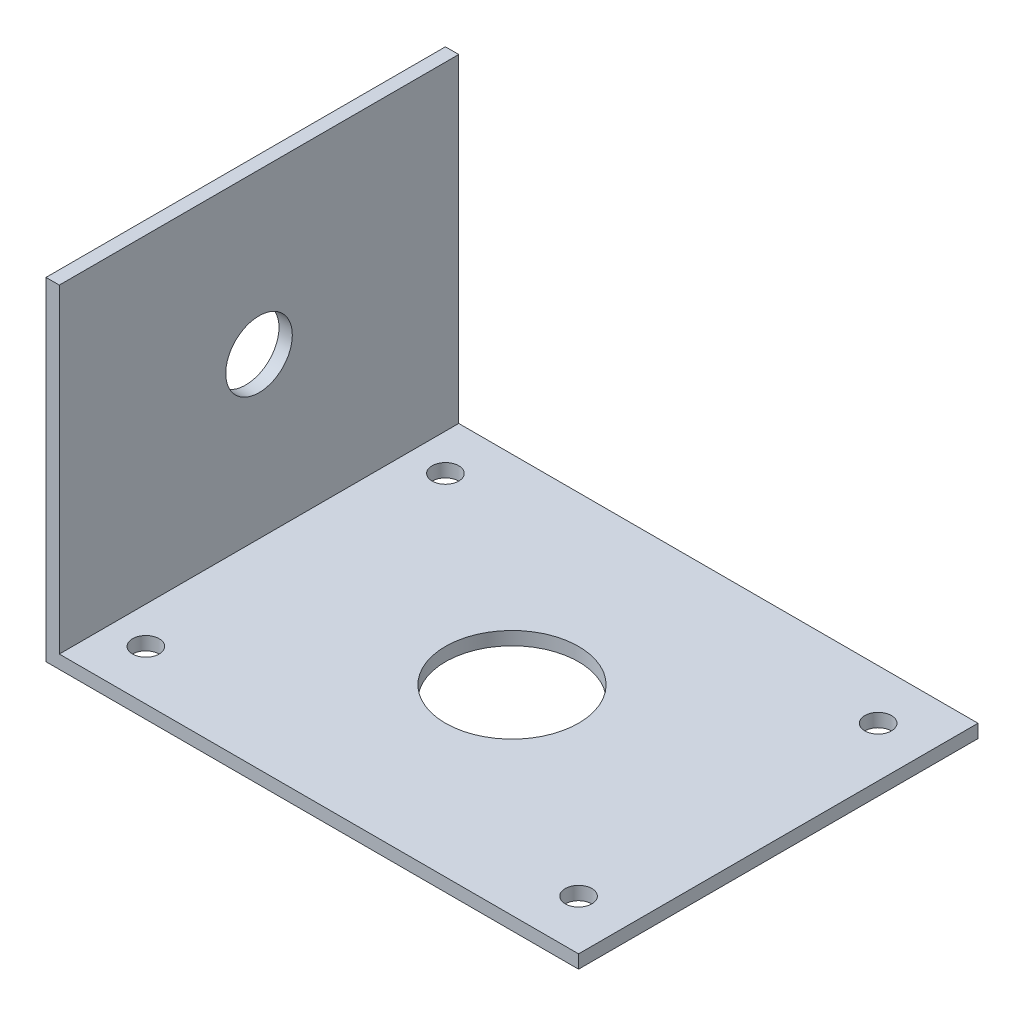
ISO-10303-21;
HEADER;
FILE_DESCRIPTION(('STEP AP214'),'2;1');
FILE_NAME('part.step','',(''),(''),'','','');
FILE_SCHEMA(('AUTOMOTIVE_DESIGN { 1 0 10303 214 1 1 1 1 }'));
ENDSEC;
DATA;
#1=APPLICATION_CONTEXT('core data for automotive mechanical design processes');
#2=APPLICATION_PROTOCOL_DEFINITION('international standard','automotive_design',2000,#1);
#3=PRODUCT_CONTEXT('',#1,'mechanical');
#4=PRODUCT('Part','Part','',(#3));
#5=PRODUCT_RELATED_PRODUCT_CATEGORY('part','',(#4));
#6=PRODUCT_DEFINITION_FORMATION('','',#4);
#7=PRODUCT_DEFINITION_CONTEXT('part definition',#1,'design');
#8=PRODUCT_DEFINITION('design','',#6,#7);
#9=PRODUCT_DEFINITION_SHAPE('','',#8);
#10=(LENGTH_UNIT() NAMED_UNIT(*) SI_UNIT(.MILLI.,.METRE.));
#11=(NAMED_UNIT(*) PLANE_ANGLE_UNIT() SI_UNIT($,.RADIAN.));
#12=(NAMED_UNIT(*) SI_UNIT($,.STERADIAN.) SOLID_ANGLE_UNIT());
#13=UNCERTAINTY_MEASURE_WITH_UNIT(LENGTH_MEASURE(1.E-05),#10,'distance_accuracy_value','');
#14=(GEOMETRIC_REPRESENTATION_CONTEXT(3) GLOBAL_UNCERTAINTY_ASSIGNED_CONTEXT((#13)) GLOBAL_UNIT_ASSIGNED_CONTEXT((#10,
#11,#12)) REPRESENTATION_CONTEXT('',''));
#15=CARTESIAN_POINT('',(0.,0.,0.));
#16=DIRECTION('',(0.,0.,1.));
#17=DIRECTION('',(1.,0.,0.));
#18=AXIS2_PLACEMENT_3D('',#15,#16,#17);
#19=CARTESIAN_POINT('',(0.,0.,76.2));
#20=DIRECTION('',(0.,1.,0.));
#21=DIRECTION('',(0.,0.,1.));
#22=AXIS2_PLACEMENT_3D('',#19,#20,#21);
#23=PLANE('',#22);
#24=CARTESIAN_POINT('',(92.075,0.,66.675));
#25=DIRECTION('',(0.,1.,0.));
#26=DIRECTION('',(0.,0.,1.));
#27=AXIS2_PLACEMENT_3D('',#24,#25,#26);
#28=CIRCLE('',#27,2.53999999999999);
#29=CARTESIAN_POINT('',(92.075,0.,69.215));
#30=VERTEX_POINT('',#29);
#31=EDGE_CURVE('E160',#30,#30,#28,.T.);
#32=ORIENTED_EDGE('',*,*,#31,.T.);
#33=EDGE_LOOP('',(#32));
#34=FACE_BOUND('',#33,.T.);
#35=CARTESIAN_POINT('',(92.075,0.,9.52499999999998));
#36=DIRECTION('',(0.,1.,0.));
#37=DIRECTION('',(0.,0.,1.));
#38=AXIS2_PLACEMENT_3D('',#35,#36,#37);
#39=CIRCLE('',#38,2.54000000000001);
#40=CARTESIAN_POINT('',(92.075,0.,12.065));
#41=VERTEX_POINT('',#40);
#42=EDGE_CURVE('E164',#41,#41,#39,.T.);
#43=ORIENTED_EDGE('',*,*,#42,.T.);
#44=EDGE_LOOP('',(#43));
#45=FACE_BOUND('',#44,.T.);
#46=CARTESIAN_POINT('',(9.52500000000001,0.,9.52499999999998));
#47=DIRECTION('',(0.,1.,0.));
#48=DIRECTION('',(0.,0.,1.));
#49=AXIS2_PLACEMENT_3D('',#46,#47,#48);
#50=CIRCLE('',#49,2.54);
#51=CARTESIAN_POINT('',(9.52500000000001,0.,12.065));
#52=VERTEX_POINT('',#51);
#53=EDGE_CURVE('E168',#52,#52,#50,.T.);
#54=ORIENTED_EDGE('',*,*,#53,.T.);
#55=EDGE_LOOP('',(#54));
#56=FACE_BOUND('',#55,.T.);
#57=CARTESIAN_POINT('',(9.52500000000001,0.,66.675));
#58=DIRECTION('',(0.,1.,0.));
#59=DIRECTION('',(0.,0.,1.));
#60=AXIS2_PLACEMENT_3D('',#57,#58,#59);
#61=CIRCLE('',#60,2.54);
#62=CARTESIAN_POINT('',(9.52500000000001,0.,69.215));
#63=VERTEX_POINT('',#62);
#64=EDGE_CURVE('E172',#63,#63,#61,.T.);
#65=ORIENTED_EDGE('',*,*,#64,.T.);
#66=EDGE_LOOP('',(#65));
#67=FACE_BOUND('',#66,.T.);
#68=CARTESIAN_POINT('',(50.8,0.,38.1));
#69=DIRECTION('',(0.,1.,0.));
#70=DIRECTION('',(0.,0.,1.));
#71=AXIS2_PLACEMENT_3D('',#68,#69,#70);
#72=CIRCLE('',#71,12.7);
#73=CARTESIAN_POINT('',(50.8,0.,50.8));
#74=VERTEX_POINT('',#73);
#75=EDGE_CURVE('E175',#74,#74,#72,.T.);
#76=ORIENTED_EDGE('',*,*,#75,.T.);
#77=EDGE_LOOP('',(#76));
#78=FACE_BOUND('',#77,.T.);
#79=DIRECTION('',(1.,0.,0.));
#80=VECTOR('',#79,1.);
#81=CARTESIAN_POINT('',(0.,0.,0.));
#82=LINE('',#81,#80);
#83=CARTESIAN_POINT('',(0.,0.,0.));
#84=VERTEX_POINT('',#83);
#85=CARTESIAN_POINT('',(101.6,0.,0.));
#86=VERTEX_POINT('',#85);
#87=EDGE_CURVE('E113',#84,#86,#82,.T.);
#88=ORIENTED_EDGE('',*,*,#87,.T.);
#89=DIRECTION('',(0.,0.,-1.));
#90=VECTOR('',#89,1.);
#91=CARTESIAN_POINT('',(101.6,0.,76.2));
#92=LINE('',#91,#90);
#93=CARTESIAN_POINT('',(101.6,0.,76.2));
#94=VERTEX_POINT('',#93);
#95=EDGE_CURVE('E11',#94,#86,#92,.T.);
#96=ORIENTED_EDGE('',*,*,#95,.F.);
#97=DIRECTION('',(1.,0.,0.));
#98=VECTOR('',#97,1.);
#99=CARTESIAN_POINT('',(0.,0.,76.2));
#100=LINE('',#99,#98);
#101=CARTESIAN_POINT('',(0.,0.,76.2));
#102=VERTEX_POINT('',#101);
#103=EDGE_CURVE('E78',#102,#94,#100,.T.);
#104=ORIENTED_EDGE('',*,*,#103,.F.);
#105=DIRECTION('',(0.,0.,-1.));
#106=VECTOR('',#105,1.);
#107=CARTESIAN_POINT('',(0.,0.,76.2));
#108=LINE('',#107,#106);
#109=EDGE_CURVE('E109',#102,#84,#108,.T.);
#110=ORIENTED_EDGE('',*,*,#109,.T.);
#111=EDGE_LOOP('',(#88,#96,#104,#110));
#112=FACE_BOUND('',#111,.T.);
#113=ADVANCED_FACE('F32',(#34,#45,#56,#67,#78,#112),#23,.F.);
#114=CARTESIAN_POINT('',(101.6,2.54,76.2));
#115=DIRECTION('',(1.,0.,0.));
#116=DIRECTION('',(0.,0.,-1.));
#117=AXIS2_PLACEMENT_3D('',#114,#115,#116);
#118=PLANE('',#117);
#119=DIRECTION('',(0.,-1.,0.));
#120=VECTOR('',#119,1.);
#121=CARTESIAN_POINT('',(101.6,2.54,0.));
#122=LINE('',#121,#120);
#123=CARTESIAN_POINT('',(101.6,2.54,0.));
#124=VERTEX_POINT('',#123);
#125=EDGE_CURVE('E116',#124,#86,#122,.T.);
#126=ORIENTED_EDGE('',*,*,#125,.F.);
#127=DIRECTION('',(0.,0.,-1.));
#128=VECTOR('',#127,1.);
#129=CARTESIAN_POINT('',(101.6,2.54,76.2));
#130=LINE('',#129,#128);
#131=CARTESIAN_POINT('',(101.6,2.54,76.2));
#132=VERTEX_POINT('',#131);
#133=EDGE_CURVE('E40',#132,#124,#130,.T.);
#134=ORIENTED_EDGE('',*,*,#133,.F.);
#135=DIRECTION('',(0.,-1.,0.));
#136=VECTOR('',#135,1.);
#137=CARTESIAN_POINT('',(101.6,2.54,76.2));
#138=LINE('',#137,#136);
#139=EDGE_CURVE('E190',#132,#94,#138,.T.);
#140=ORIENTED_EDGE('',*,*,#139,.T.);
#141=ORIENTED_EDGE('',*,*,#95,.T.);
#142=EDGE_LOOP('',(#126,#134,#140,#141));
#143=FACE_BOUND('',#142,.T.);
#144=ADVANCED_FACE('F135',(#143),#118,.T.);
#145=CARTESIAN_POINT('',(0.,2.54,76.2));
#146=DIRECTION('',(0.,1.,0.));
#147=DIRECTION('',(0.,0.,1.));
#148=AXIS2_PLACEMENT_3D('',#145,#146,#147);
#149=PLANE('',#148);
#150=CARTESIAN_POINT('',(92.075,2.54,66.675));
#151=DIRECTION('',(0.,1.,0.));
#152=DIRECTION('',(0.,0.,1.));
#153=AXIS2_PLACEMENT_3D('',#150,#151,#152);
#154=CIRCLE('',#153,2.53999999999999);
#155=CARTESIAN_POINT('',(92.075,2.54,69.215));
#156=VERTEX_POINT('',#155);
#157=EDGE_CURVE('E212',#156,#156,#154,.T.);
#158=ORIENTED_EDGE('',*,*,#157,.F.);
#159=EDGE_LOOP('',(#158));
#160=FACE_BOUND('',#159,.T.);
#161=CARTESIAN_POINT('',(92.075,2.54,9.52499999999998));
#162=DIRECTION('',(0.,1.,0.));
#163=DIRECTION('',(0.,0.,1.));
#164=AXIS2_PLACEMENT_3D('',#161,#162,#163);
#165=CIRCLE('',#164,2.54000000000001);
#166=CARTESIAN_POINT('',(92.075,2.54,12.065));
#167=VERTEX_POINT('',#166);
#168=EDGE_CURVE('E216',#167,#167,#165,.T.);
#169=ORIENTED_EDGE('',*,*,#168,.F.);
#170=EDGE_LOOP('',(#169));
#171=FACE_BOUND('',#170,.T.);
#172=CARTESIAN_POINT('',(9.52500000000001,2.54,9.52499999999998));
#173=DIRECTION('',(0.,1.,0.));
#174=DIRECTION('',(0.,0.,1.));
#175=AXIS2_PLACEMENT_3D('',#172,#173,#174);
#176=CIRCLE('',#175,2.54);
#177=CARTESIAN_POINT('',(9.52500000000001,2.54,12.065));
#178=VERTEX_POINT('',#177);
#179=EDGE_CURVE('E220',#178,#178,#176,.T.);
#180=ORIENTED_EDGE('',*,*,#179,.F.);
#181=EDGE_LOOP('',(#180));
#182=FACE_BOUND('',#181,.T.);
#183=CARTESIAN_POINT('',(9.52500000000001,2.54,66.675));
#184=DIRECTION('',(0.,1.,0.));
#185=DIRECTION('',(0.,0.,1.));
#186=AXIS2_PLACEMENT_3D('',#183,#184,#185);
#187=CIRCLE('',#186,2.54);
#188=CARTESIAN_POINT('',(9.52500000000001,2.54,69.215));
#189=VERTEX_POINT('',#188);
#190=EDGE_CURVE('E185',#189,#189,#187,.T.);
#191=ORIENTED_EDGE('',*,*,#190,.F.);
#192=EDGE_LOOP('',(#191));
#193=FACE_BOUND('',#192,.T.);
#194=CARTESIAN_POINT('',(50.8,2.54,38.1));
#195=DIRECTION('',(0.,1.,0.));
#196=DIRECTION('',(0.,0.,1.));
#197=AXIS2_PLACEMENT_3D('',#194,#195,#196);
#198=CIRCLE('',#197,12.7);
#199=CARTESIAN_POINT('',(50.8,2.54,50.8));
#200=VERTEX_POINT('',#199);
#201=EDGE_CURVE('E178',#200,#200,#198,.T.);
#202=ORIENTED_EDGE('',*,*,#201,.F.);
#203=EDGE_LOOP('',(#202));
#204=FACE_BOUND('',#203,.T.);
#205=DIRECTION('',(1.,0.,0.));
#206=VECTOR('',#205,1.);
#207=CARTESIAN_POINT('',(0.,2.54,0.));
#208=LINE('',#207,#206);
#209=CARTESIAN_POINT('',(2.54,2.54,0.));
#210=VERTEX_POINT('',#209);
#211=EDGE_CURVE('E120',#210,#124,#208,.T.);
#212=ORIENTED_EDGE('',*,*,#211,.F.);
#213=DIRECTION('',(0.,0.,-1.));
#214=VECTOR('',#213,1.);
#215=CARTESIAN_POINT('',(2.54,2.54,76.2));
#216=LINE('',#215,#214);
#217=CARTESIAN_POINT('',(2.54,2.54,76.2));
#218=VERTEX_POINT('',#217);
#219=EDGE_CURVE('E99',#218,#210,#216,.T.);
#220=ORIENTED_EDGE('',*,*,#219,.F.);
#221=DIRECTION('',(1.,0.,0.));
#222=VECTOR('',#221,1.);
#223=CARTESIAN_POINT('',(0.,2.54,76.2));
#224=LINE('',#223,#222);
#225=EDGE_CURVE('E105',#218,#132,#224,.T.);
#226=ORIENTED_EDGE('',*,*,#225,.T.);
#227=ORIENTED_EDGE('',*,*,#133,.T.);
#228=EDGE_LOOP('',(#212,#220,#226,#227));
#229=FACE_BOUND('',#228,.T.);
#230=ADVANCED_FACE('F132',(#160,#171,#182,#193,#204,#229),#149,.T.);
#231=CARTESIAN_POINT('',(2.54,63.5,76.2));
#232=DIRECTION('',(1.,0.,0.));
#233=DIRECTION('',(0.,1.,0.));
#234=AXIS2_PLACEMENT_3D('',#231,#232,#233);
#235=PLANE('',#234);
#236=CARTESIAN_POINT('',(2.54,33.02,38.1));
#237=DIRECTION('',(1.,0.,0.));
#238=DIRECTION('',(0.,0.,-1.));
#239=AXIS2_PLACEMENT_3D('',#236,#237,#238);
#240=CIRCLE('',#239,6.35);
#241=CARTESIAN_POINT('',(2.54,33.02,31.75));
#242=VERTEX_POINT('',#241);
#243=EDGE_CURVE('E177',#242,#242,#240,.T.);
#244=ORIENTED_EDGE('',*,*,#243,.F.);
#245=EDGE_LOOP('',(#244));
#246=FACE_BOUND('',#245,.T.);
#247=DIRECTION('',(0.,-1.,0.));
#248=VECTOR('',#247,1.);
#249=CARTESIAN_POINT('',(2.54,63.5,0.));
#250=LINE('',#249,#248);
#251=CARTESIAN_POINT('',(2.54,63.5,0.));
#252=VERTEX_POINT('',#251);
#253=EDGE_CURVE('E94',#252,#210,#250,.T.);
#254=ORIENTED_EDGE('',*,*,#253,.F.);
#255=DIRECTION('',(0.,0.,-1.));
#256=VECTOR('',#255,1.);
#257=CARTESIAN_POINT('',(2.54,63.5,76.2));
#258=LINE('',#257,#256);
#259=CARTESIAN_POINT('',(2.54,63.5,76.2));
#260=VERTEX_POINT('',#259);
#261=EDGE_CURVE('E89',#260,#252,#258,.T.);
#262=ORIENTED_EDGE('',*,*,#261,.F.);
#263=DIRECTION('',(0.,-1.,0.));
#264=VECTOR('',#263,1.);
#265=CARTESIAN_POINT('',(2.54,63.5,76.2));
#266=LINE('',#265,#264);
#267=EDGE_CURVE('E92',#260,#218,#266,.T.);
#268=ORIENTED_EDGE('',*,*,#267,.T.);
#269=ORIENTED_EDGE('',*,*,#219,.T.);
#270=EDGE_LOOP('',(#254,#262,#268,#269));
#271=FACE_BOUND('',#270,.T.);
#272=ADVANCED_FACE('F91',(#246,#271),#235,.T.);
#273=CARTESIAN_POINT('',(0.,63.5,76.2));
#274=DIRECTION('',(0.,1.,0.));
#275=DIRECTION('',(0.,0.,1.));
#276=AXIS2_PLACEMENT_3D('',#273,#274,#275);
#277=PLANE('',#276);
#278=DIRECTION('',(1.,0.,0.));
#279=VECTOR('',#278,1.);
#280=CARTESIAN_POINT('',(0.,63.5,0.));
#281=LINE('',#280,#279);
#282=CARTESIAN_POINT('',(0.,63.5,0.));
#283=VERTEX_POINT('',#282);
#284=EDGE_CURVE('E124',#283,#252,#281,.T.);
#285=ORIENTED_EDGE('',*,*,#284,.F.);
#286=DIRECTION('',(0.,0.,-1.));
#287=VECTOR('',#286,1.);
#288=CARTESIAN_POINT('',(0.,63.5,76.2));
#289=LINE('',#288,#287);
#290=CARTESIAN_POINT('',(0.,63.5,76.2));
#291=VERTEX_POINT('',#290);
#292=EDGE_CURVE('E69',#291,#283,#289,.T.);
#293=ORIENTED_EDGE('',*,*,#292,.F.);
#294=DIRECTION('',(1.,0.,0.));
#295=VECTOR('',#294,1.);
#296=CARTESIAN_POINT('',(0.,63.5,76.2));
#297=LINE('',#296,#295);
#298=EDGE_CURVE('E103',#291,#260,#297,.T.);
#299=ORIENTED_EDGE('',*,*,#298,.T.);
#300=ORIENTED_EDGE('',*,*,#261,.T.);
#301=EDGE_LOOP('',(#285,#293,#299,#300));
#302=FACE_BOUND('',#301,.T.);
#303=ADVANCED_FACE('F107',(#302),#277,.T.);
#304=CARTESIAN_POINT('',(0.,63.5,76.2));
#305=DIRECTION('',(1.,0.,0.));
#306=DIRECTION('',(0.,1.,0.));
#307=AXIS2_PLACEMENT_3D('',#304,#305,#306);
#308=PLANE('',#307);
#309=CARTESIAN_POINT('',(0.,33.02,38.1));
#310=DIRECTION('',(1.,0.,0.));
#311=DIRECTION('',(0.,0.,-1.));
#312=AXIS2_PLACEMENT_3D('',#309,#310,#311);
#313=CIRCLE('',#312,6.35);
#314=CARTESIAN_POINT('',(0.,33.02,31.75));
#315=VERTEX_POINT('',#314);
#316=EDGE_CURVE('E117',#315,#315,#313,.T.);
#317=ORIENTED_EDGE('',*,*,#316,.T.);
#318=EDGE_LOOP('',(#317));
#319=FACE_BOUND('',#318,.T.);
#320=DIRECTION('',(0.,-1.,0.));
#321=VECTOR('',#320,1.);
#322=CARTESIAN_POINT('',(0.,63.5,0.));
#323=LINE('',#322,#321);
#324=EDGE_CURVE('E72',#283,#84,#323,.T.);
#325=ORIENTED_EDGE('',*,*,#324,.T.);
#326=ORIENTED_EDGE('',*,*,#109,.F.);
#327=DIRECTION('',(0.,-1.,0.));
#328=VECTOR('',#327,1.);
#329=CARTESIAN_POINT('',(0.,63.5,76.2));
#330=LINE('',#329,#328);
#331=EDGE_CURVE('E48',#291,#102,#330,.T.);
#332=ORIENTED_EDGE('',*,*,#331,.F.);
#333=ORIENTED_EDGE('',*,*,#292,.T.);
#334=EDGE_LOOP('',(#325,#326,#332,#333));
#335=FACE_BOUND('',#334,.T.);
#336=ADVANCED_FACE('F140',(#319,#335),#308,.F.);
#337=CARTESIAN_POINT('',(101.6,0.,76.2));
#338=DIRECTION('',(0.,0.,-1.));
#339=DIRECTION('',(-1.,0.,0.));
#340=AXIS2_PLACEMENT_3D('',#337,#338,#339);
#341=PLANE('',#340);
#342=ORIENTED_EDGE('',*,*,#103,.T.);
#343=ORIENTED_EDGE('',*,*,#139,.F.);
#344=ORIENTED_EDGE('',*,*,#225,.F.);
#345=ORIENTED_EDGE('',*,*,#267,.F.);
#346=ORIENTED_EDGE('',*,*,#298,.F.);
#347=ORIENTED_EDGE('',*,*,#331,.T.);
#348=EDGE_LOOP('',(#342,#343,#344,#345,#346,#347));
#349=FACE_BOUND('',#348,.T.);
#350=ADVANCED_FACE('F102',(#349),#341,.F.);
#351=CARTESIAN_POINT('',(101.6,0.,0.));
#352=DIRECTION('',(0.,0.,-1.));
#353=DIRECTION('',(-1.,0.,0.));
#354=AXIS2_PLACEMENT_3D('',#351,#352,#353);
#355=PLANE('',#354);
#356=ORIENTED_EDGE('',*,*,#87,.F.);
#357=ORIENTED_EDGE('',*,*,#324,.F.);
#358=ORIENTED_EDGE('',*,*,#284,.T.);
#359=ORIENTED_EDGE('',*,*,#253,.T.);
#360=ORIENTED_EDGE('',*,*,#211,.T.);
#361=ORIENTED_EDGE('',*,*,#125,.T.);
#362=EDGE_LOOP('',(#356,#357,#358,#359,#360,#361));
#363=FACE_BOUND('',#362,.T.);
#364=ADVANCED_FACE('F138',(#363),#355,.T.);
#365=CARTESIAN_POINT('',(0.,33.02,38.1));
#366=DIRECTION('',(1.,0.,0.));
#367=DIRECTION('',(0.,0.,-1.));
#368=AXIS2_PLACEMENT_3D('',#365,#366,#367);
#369=CYLINDRICAL_SURFACE('',#368,6.35);
#370=ORIENTED_EDGE('',*,*,#316,.F.);
#371=EDGE_LOOP('',(#370));
#372=FACE_BOUND('',#371,.T.);
#373=ORIENTED_EDGE('',*,*,#243,.T.);
#374=EDGE_LOOP('',(#373));
#375=FACE_BOUND('',#374,.T.);
#376=ADVANCED_FACE('F193',(#372,#375),#369,.F.);
#377=CARTESIAN_POINT('',(50.8,0.,38.1));
#378=DIRECTION('',(0.,1.,0.));
#379=DIRECTION('',(0.,0.,1.));
#380=AXIS2_PLACEMENT_3D('',#377,#378,#379);
#381=CYLINDRICAL_SURFACE('',#380,12.7);
#382=ORIENTED_EDGE('',*,*,#75,.F.);
#383=EDGE_LOOP('',(#382));
#384=FACE_BOUND('',#383,.T.);
#385=ORIENTED_EDGE('',*,*,#201,.T.);
#386=EDGE_LOOP('',(#385));
#387=FACE_BOUND('',#386,.T.);
#388=ADVANCED_FACE('F196',(#384,#387),#381,.F.);
#389=CARTESIAN_POINT('',(9.52500000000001,0.,66.675));
#390=DIRECTION('',(0.,1.,0.));
#391=DIRECTION('',(0.,0.,1.));
#392=AXIS2_PLACEMENT_3D('',#389,#390,#391);
#393=CYLINDRICAL_SURFACE('',#392,2.54);
#394=ORIENTED_EDGE('',*,*,#64,.F.);
#395=EDGE_LOOP('',(#394));
#396=FACE_BOUND('',#395,.T.);
#397=ORIENTED_EDGE('',*,*,#190,.T.);
#398=EDGE_LOOP('',(#397));
#399=FACE_BOUND('',#398,.T.);
#400=ADVANCED_FACE('F227',(#396,#399),#393,.F.);
#401=CARTESIAN_POINT('',(9.52500000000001,0.,9.52499999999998));
#402=DIRECTION('',(0.,1.,0.));
#403=DIRECTION('',(0.,0.,1.));
#404=AXIS2_PLACEMENT_3D('',#401,#402,#403);
#405=CYLINDRICAL_SURFACE('',#404,2.54);
#406=ORIENTED_EDGE('',*,*,#53,.F.);
#407=EDGE_LOOP('',(#406));
#408=FACE_BOUND('',#407,.T.);
#409=ORIENTED_EDGE('',*,*,#179,.T.);
#410=EDGE_LOOP('',(#409));
#411=FACE_BOUND('',#410,.T.);
#412=ADVANCED_FACE('F232',(#408,#411),#405,.F.);
#413=CARTESIAN_POINT('',(92.075,0.,9.52499999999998));
#414=DIRECTION('',(0.,1.,0.));
#415=DIRECTION('',(0.,0.,1.));
#416=AXIS2_PLACEMENT_3D('',#413,#414,#415);
#417=CYLINDRICAL_SURFACE('',#416,2.54000000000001);
#418=ORIENTED_EDGE('',*,*,#42,.F.);
#419=EDGE_LOOP('',(#418));
#420=FACE_BOUND('',#419,.T.);
#421=ORIENTED_EDGE('',*,*,#168,.T.);
#422=EDGE_LOOP('',(#421));
#423=FACE_BOUND('',#422,.T.);
#424=ADVANCED_FACE('F276',(#420,#423),#417,.F.);
#425=CARTESIAN_POINT('',(92.075,0.,66.675));
#426=DIRECTION('',(0.,1.,0.));
#427=DIRECTION('',(0.,0.,1.));
#428=AXIS2_PLACEMENT_3D('',#425,#426,#427);
#429=CYLINDRICAL_SURFACE('',#428,2.53999999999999);
#430=ORIENTED_EDGE('',*,*,#31,.F.);
#431=EDGE_LOOP('',(#430));
#432=FACE_BOUND('',#431,.T.);
#433=ORIENTED_EDGE('',*,*,#157,.T.);
#434=EDGE_LOOP('',(#433));
#435=FACE_BOUND('',#434,.T.);
#436=ADVANCED_FACE('F285',(#432,#435),#429,.F.);
#437=CLOSED_SHELL('',(#113,#144,#230,#272,#303,#336,#350,#364,#376,#388,#400,#412,#424,#436));
#438=MANIFOLD_SOLID_BREP('B2',#437);
#439=ADVANCED_BREP_SHAPE_REPRESENTATION('',(#18,#438),#14);
#440=SHAPE_DEFINITION_REPRESENTATION(#9,#439);
ENDSEC;
END-ISO-10303-21;
